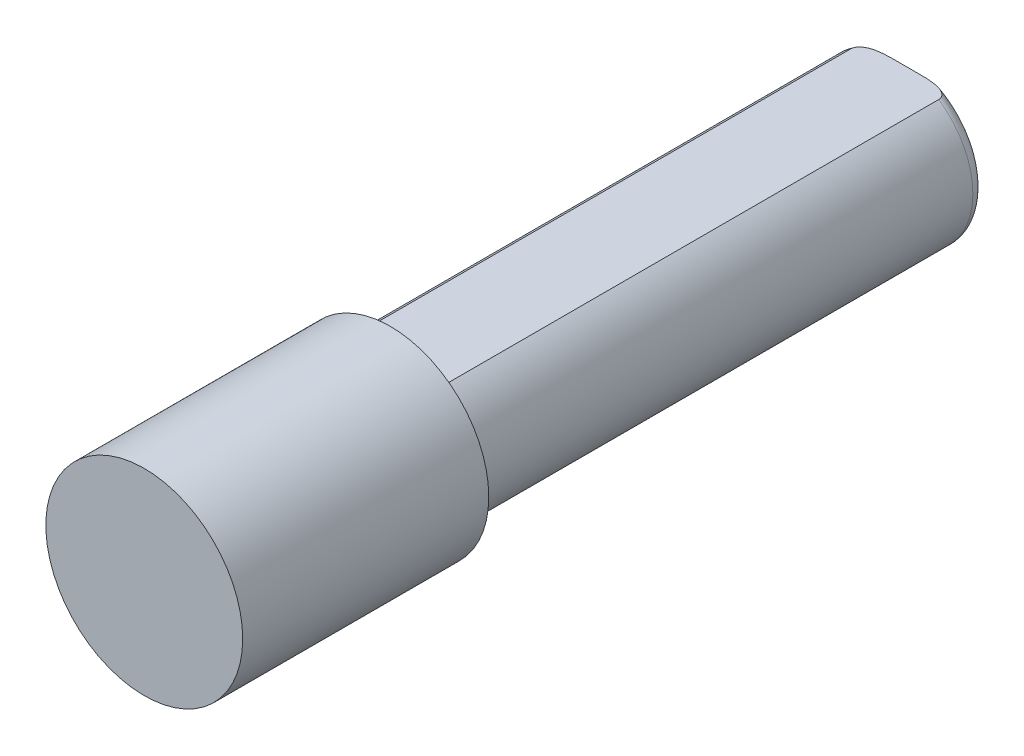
from build123d import *

# Parameters (mm, degrees)
SKETCH_1_R          = 3.175
EXTRUDE_1_DEPTH     = 21
SKETCH_2_R          = 4
EXTRUDE_2_DEPTH     = 10
CUT_EXTRUDE_1_DEPTH = 21
FILLET_1_R          = 0.5


with BuildPart() as part:
    # Sketch 1 → Extrude 1 (new body)
    with BuildSketch(Plane.XY):
        with Locations(Location((0, 0, 0), (0, 0, 180))):
            Circle(SKETCH_1_R)
    extrude(amount=EXTRUDE_1_DEPTH)

    # Sketch 2 → Extrude 2 (add)
    with BuildSketch(Plane.XY.offset(21)):
        Circle(SKETCH_2_R)
    extrude(amount=EXTRUDE_2_DEPTH)

    # Sketch 3 → Cut-Extrude 1 (cut)
    with BuildSketch(Plane(origin=(0, 0, 0), x_dir=(-1, 0, 0), z_dir=(0, 0, -1))):
        with BuildLine():
            Line((-1.78605711, 2.625), (1.78605711, 2.625))
            ThreePointArc((1.78605711, 2.625), (0, 3.175), (-1.78605711, 2.625))
        make_face()
    extrude(amount=-CUT_EXTRUDE_1_DEPTH, mode=Mode.SUBTRACT)

    # Fillet 1
    fillet_1_edges = [part.edges().sort_by_distance(p)[0] for p in [
        (0, -3.175, 0),
    ]]
    fillet(fillet_1_edges, radius=FILLET_1_R)


solid = part.part
